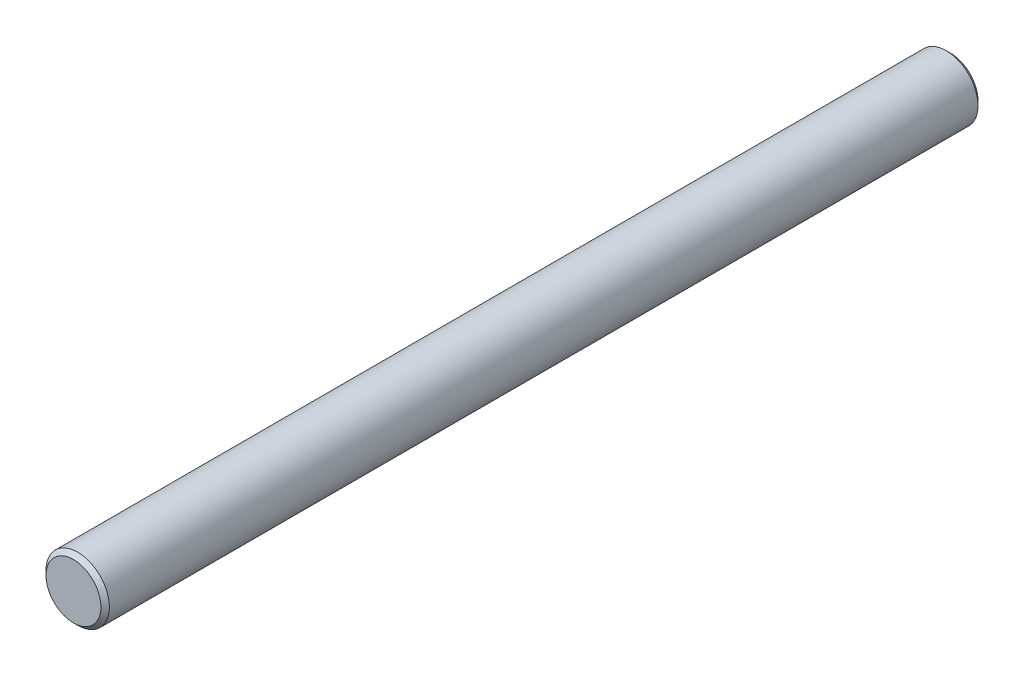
ISO-10303-21;
HEADER;
FILE_DESCRIPTION(('STEP AP214'),'2;1');
FILE_NAME('part.step','',(''),(''),'','','');
FILE_SCHEMA(('AUTOMOTIVE_DESIGN { 1 0 10303 214 1 1 1 1 }'));
ENDSEC;
DATA;
#1=APPLICATION_CONTEXT('core data for automotive mechanical design processes');
#2=APPLICATION_PROTOCOL_DEFINITION('international standard','automotive_design',2000,#1);
#3=PRODUCT_CONTEXT('',#1,'mechanical');
#4=PRODUCT('Part','Part','',(#3));
#5=PRODUCT_RELATED_PRODUCT_CATEGORY('part','',(#4));
#6=PRODUCT_DEFINITION_FORMATION('','',#4);
#7=PRODUCT_DEFINITION_CONTEXT('part definition',#1,'design');
#8=PRODUCT_DEFINITION('design','',#6,#7);
#9=PRODUCT_DEFINITION_SHAPE('','',#8);
#10=(LENGTH_UNIT() NAMED_UNIT(*) SI_UNIT(.MILLI.,.METRE.));
#11=(NAMED_UNIT(*) PLANE_ANGLE_UNIT() SI_UNIT($,.RADIAN.));
#12=(NAMED_UNIT(*) SI_UNIT($,.STERADIAN.) SOLID_ANGLE_UNIT());
#13=UNCERTAINTY_MEASURE_WITH_UNIT(LENGTH_MEASURE(1.E-05),#10,'distance_accuracy_value','');
#14=(GEOMETRIC_REPRESENTATION_CONTEXT(3) GLOBAL_UNCERTAINTY_ASSIGNED_CONTEXT((#13)) GLOBAL_UNIT_ASSIGNED_CONTEXT((#10,
#11,#12)) REPRESENTATION_CONTEXT('',''));
#15=CARTESIAN_POINT('',(0.,0.,0.));
#16=DIRECTION('',(0.,0.,1.));
#17=DIRECTION('',(1.,0.,0.));
#18=AXIS2_PLACEMENT_3D('',#15,#16,#17);
#19=CARTESIAN_POINT('',(0.,0.,20.75));
#20=DIRECTION('',(0.,0.,-1.));
#21=DIRECTION('',(-1.,0.,0.));
#22=AXIS2_PLACEMENT_3D('',#19,#20,#21);
#23=CYLINDRICAL_SURFACE('',#22,1.5);
#24=CARTESIAN_POINT('',(0.,0.,-20.55));
#25=DIRECTION('',(0.,0.,1.));
#26=DIRECTION('',(1.,0.,0.));
#27=AXIS2_PLACEMENT_3D('',#24,#25,#26);
#28=CIRCLE('',#27,1.5);
#29=CARTESIAN_POINT('',(-1.50000000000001,0.,-20.55));
#30=VERTEX_POINT('',#29);
#31=EDGE_CURVE('E39',#30,#30,#28,.T.);
#32=CARTESIAN_POINT('',(0.,0.,20.55));
#33=DIRECTION('',(0.,0.,1.));
#34=DIRECTION('',(1.,0.,0.));
#35=AXIS2_PLACEMENT_3D('',#32,#33,#34);
#36=CIRCLE('',#35,1.5);
#37=CARTESIAN_POINT('',(-1.50000000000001,0.,20.55));
#38=VERTEX_POINT('',#37);
#39=EDGE_CURVE('E43',#38,#38,#36,.F.);
#40=CARTESIAN_POINT('',(-1.50000000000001,0.,-20.55));
#41=CARTESIAN_POINT('',(-1.50000000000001,0.,-20.121875));
#42=CARTESIAN_POINT('',(-1.50000000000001,0.,-19.69375));
#43=CARTESIAN_POINT('',(-1.50000000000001,0.,-18.8375));
#44=CARTESIAN_POINT('',(-1.50000000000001,0.,-18.409375));
#45=CARTESIAN_POINT('',(-1.50000000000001,0.,-17.553125));
#46=CARTESIAN_POINT('',(-1.50000000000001,0.,-17.125));
#47=CARTESIAN_POINT('',(-1.50000000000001,0.,-16.26875));
#48=CARTESIAN_POINT('',(-1.50000000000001,0.,-15.840625));
#49=CARTESIAN_POINT('',(-1.50000000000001,0.,-14.984375));
#50=CARTESIAN_POINT('',(-1.50000000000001,0.,-14.55625));
#51=CARTESIAN_POINT('',(-1.50000000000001,0.,-13.7));
#52=CARTESIAN_POINT('',(-1.50000000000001,0.,-13.271875));
#53=CARTESIAN_POINT('',(-1.50000000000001,0.,-12.415625));
#54=CARTESIAN_POINT('',(-1.50000000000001,0.,-11.9875));
#55=CARTESIAN_POINT('',(-1.50000000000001,0.,-11.13125));
#56=CARTESIAN_POINT('',(-1.50000000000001,0.,-10.703125));
#57=CARTESIAN_POINT('',(-1.50000000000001,0.,-9.84687500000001));
#58=CARTESIAN_POINT('',(-1.50000000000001,0.,-9.41875));
#59=CARTESIAN_POINT('',(-1.50000000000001,0.,-8.56250000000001));
#60=CARTESIAN_POINT('',(-1.50000000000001,0.,-8.134375));
#61=CARTESIAN_POINT('',(-1.50000000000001,0.,-7.27812500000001));
#62=CARTESIAN_POINT('',(-1.50000000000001,0.,-6.85000000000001));
#63=CARTESIAN_POINT('',(-1.50000000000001,0.,-5.99375000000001));
#64=CARTESIAN_POINT('',(-1.50000000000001,0.,-5.56562500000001));
#65=CARTESIAN_POINT('',(-1.50000000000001,0.,-4.70937500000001));
#66=CARTESIAN_POINT('',(-1.50000000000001,0.,-4.28125000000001));
#67=CARTESIAN_POINT('',(-1.50000000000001,0.,-3.42500000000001));
#68=CARTESIAN_POINT('',(-1.50000000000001,0.,-2.99687500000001));
#69=CARTESIAN_POINT('',(-1.50000000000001,0.,-2.14062500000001));
#70=CARTESIAN_POINT('',(-1.50000000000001,0.,-1.71250000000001));
#71=CARTESIAN_POINT('',(-1.50000000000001,0.,-0.856250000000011));
#72=CARTESIAN_POINT('',(-1.50000000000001,0.,-0.428125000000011));
#73=CARTESIAN_POINT('',(-1.50000000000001,0.,0.42812499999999));
#74=CARTESIAN_POINT('',(-1.50000000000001,0.,0.85624999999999));
#75=CARTESIAN_POINT('',(-1.50000000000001,0.,1.71249999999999));
#76=CARTESIAN_POINT('',(-1.50000000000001,0.,2.14062499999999));
#77=CARTESIAN_POINT('',(-1.50000000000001,0.,2.99687499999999));
#78=CARTESIAN_POINT('',(-1.50000000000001,0.,3.42499999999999));
#79=CARTESIAN_POINT('',(-1.50000000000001,0.,4.28124999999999));
#80=CARTESIAN_POINT('',(-1.50000000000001,0.,4.70937499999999));
#81=CARTESIAN_POINT('',(-1.50000000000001,0.,5.56562499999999));
#82=CARTESIAN_POINT('',(-1.50000000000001,0.,5.99374999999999));
#83=CARTESIAN_POINT('',(-1.50000000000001,0.,6.84999999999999));
#84=CARTESIAN_POINT('',(-1.50000000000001,0.,7.27812499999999));
#85=CARTESIAN_POINT('',(-1.50000000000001,0.,8.13437499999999));
#86=CARTESIAN_POINT('',(-1.50000000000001,0.,8.56249999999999));
#87=CARTESIAN_POINT('',(-1.50000000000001,0.,9.41874999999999));
#88=CARTESIAN_POINT('',(-1.50000000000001,0.,9.84687499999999));
#89=CARTESIAN_POINT('',(-1.50000000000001,0.,10.703125));
#90=CARTESIAN_POINT('',(-1.50000000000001,0.,11.13125));
#91=CARTESIAN_POINT('',(-1.50000000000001,0.,11.9875));
#92=CARTESIAN_POINT('',(-1.50000000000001,0.,12.415625));
#93=CARTESIAN_POINT('',(-1.50000000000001,0.,13.271875));
#94=CARTESIAN_POINT('',(-1.50000000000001,0.,13.7));
#95=CARTESIAN_POINT('',(-1.50000000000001,0.,14.55625));
#96=CARTESIAN_POINT('',(-1.50000000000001,0.,14.984375));
#97=CARTESIAN_POINT('',(-1.50000000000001,0.,15.840625));
#98=CARTESIAN_POINT('',(-1.50000000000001,0.,16.26875));
#99=CARTESIAN_POINT('',(-1.50000000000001,0.,17.125));
#100=CARTESIAN_POINT('',(-1.50000000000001,0.,17.553125));
#101=CARTESIAN_POINT('',(-1.50000000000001,0.,18.409375));
#102=CARTESIAN_POINT('',(-1.50000000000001,0.,18.8375));
#103=CARTESIAN_POINT('',(-1.50000000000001,0.,19.69375));
#104=CARTESIAN_POINT('',(-1.50000000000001,0.,20.121875));
#105=CARTESIAN_POINT('',(-1.50000000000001,0.,20.55));
#106=B_SPLINE_CURVE_WITH_KNOTS('',3,(#40,#41,#42,#43,#44,#45,#46,#47,#48,#49,#50,#51,#52,#53,
#54,#55,#56,#57,#58,#59,#60,#61,#62,#63,#64,#65,#66,#67,#68,#69,#70,#71,#72,#73,#74,#75,#76,#77,
#78,#79,#80,#81,#82,#83,#84,#85,#86,#87,#88,#89,#90,#91,#92,#93,#94,#95,#96,#97,#98,#99,#100,
#101,#102,#103,#104,#105),.UNSPECIFIED.,.F.,.F.,(4,2,2,2,2,2,2,2,2,2,2,2,2,2,2,2,2,2,2,2,2,2,2,
2,2,2,2,2,2,2,2,2,4),(0.,1.284375,2.56875,3.853125,5.1375,6.421875,7.70625,8.990625,10.275,
11.559375,12.84375,14.128125,15.4125,16.696875,17.98125,19.265625,20.55,21.834375,23.11875,
24.403125,25.6875,26.971875,28.25625,29.540625,30.825,32.109375,33.39375,34.678125,35.9625,
37.246875,38.53125,39.815625,41.1),.UNSPECIFIED.);
#107=EDGE_CURVE('BSEAM29',#30,#38,#106,.T.);
#108=ORIENTED_EDGE('',*,*,#31,.T.);
#109=ORIENTED_EDGE('',*,*,#39,.T.);
#110=ORIENTED_EDGE('',*,*,#107,.T.);
#111=ORIENTED_EDGE('',*,*,#107,.F.);
#112=EDGE_LOOP('',(#108,#110,#109,#111));
#113=FACE_BOUND('',#112,.T.);
#114=ADVANCED_FACE('F29',(#113),#23,.T.);
#115=CARTESIAN_POINT('',(0.,0.,20.75));
#116=DIRECTION('',(0.,0.,1.));
#117=DIRECTION('',(1.,0.,0.));
#118=AXIS2_PLACEMENT_3D('',#115,#116,#117);
#119=PLANE('',#118);
#120=CARTESIAN_POINT('',(0.,0.,20.75));
#121=DIRECTION('',(0.,0.,1.));
#122=DIRECTION('',(1.,0.,0.));
#123=AXIS2_PLACEMENT_3D('',#120,#121,#122);
#124=CIRCLE('',#123,1.3);
#125=CARTESIAN_POINT('',(-1.30000000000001,0.,20.75));
#126=VERTEX_POINT('',#125);
#127=EDGE_CURVE('E10',#126,#126,#124,.T.);
#128=ORIENTED_EDGE('',*,*,#127,.T.);
#129=EDGE_LOOP('',(#128));
#130=FACE_BOUND('',#129,.T.);
#131=ADVANCED_FACE('F62',(#130),#119,.T.);
#132=CARTESIAN_POINT('',(0.,0.,-20.75));
#133=DIRECTION('',(0.,0.,1.));
#134=DIRECTION('',(1.,0.,0.));
#135=AXIS2_PLACEMENT_3D('',#132,#133,#134);
#136=PLANE('',#135);
#137=CARTESIAN_POINT('',(0.,0.,-20.75));
#138=DIRECTION('',(0.,0.,1.));
#139=DIRECTION('',(1.,0.,0.));
#140=AXIS2_PLACEMENT_3D('',#137,#138,#139);
#141=CIRCLE('',#140,1.3);
#142=CARTESIAN_POINT('',(1.30000000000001,0.,-20.75));
#143=VERTEX_POINT('',#142);
#144=EDGE_CURVE('E35',#143,#143,#141,.F.);
#145=ORIENTED_EDGE('',*,*,#144,.T.);
#146=EDGE_LOOP('',(#145));
#147=FACE_BOUND('',#146,.T.);
#148=ADVANCED_FACE('F58',(#147),#136,.F.);
#149=CARTESIAN_POINT('',(0.,0.,-20.55));
#150=DIRECTION('',(0.,0.,1.));
#151=DIRECTION('',(1.,0.,0.));
#152=AXIS2_PLACEMENT_3D('',#149,#150,#151);
#153=CONICAL_SURFACE('',#152,1.5,0.785398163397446);
#154=ORIENTED_EDGE('',*,*,#144,.F.);
#155=EDGE_LOOP('',(#154));
#156=FACE_BOUND('',#155,.T.);
#157=ORIENTED_EDGE('',*,*,#31,.F.);
#158=EDGE_LOOP('',(#157));
#159=FACE_BOUND('',#158,.T.);
#160=ADVANCED_FACE('F53',(#156,#159),#153,.T.);
#161=CARTESIAN_POINT('',(0.,0.,20.75));
#162=DIRECTION('',(0.,0.,-1.));
#163=DIRECTION('',(-1.,0.,0.));
#164=AXIS2_PLACEMENT_3D('',#161,#162,#163);
#165=CONICAL_SURFACE('',#164,1.3,0.785398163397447);
#166=CARTESIAN_POINT('',(-1.50000000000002,0.,20.55));
#167=CARTESIAN_POINT('',(-1.49791666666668,0.,20.5520833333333));
#168=CARTESIAN_POINT('',(-1.49583333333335,0.,20.5541666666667));
#169=CARTESIAN_POINT('',(-1.49166666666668,0.,20.5583333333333));
#170=CARTESIAN_POINT('',(-1.48958333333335,0.,20.5604166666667));
#171=CARTESIAN_POINT('',(-1.48541666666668,0.,20.5645833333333));
#172=CARTESIAN_POINT('',(-1.48333333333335,0.,20.5666666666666));
#173=CARTESIAN_POINT('',(-1.47916666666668,0.,20.5708333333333));
#174=CARTESIAN_POINT('',(-1.47708333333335,0.,20.5729166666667));
#175=CARTESIAN_POINT('',(-1.47291666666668,0.,20.5770833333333));
#176=CARTESIAN_POINT('',(-1.47083333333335,0.,20.5791666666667));
#177=CARTESIAN_POINT('',(-1.46666666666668,0.,20.5833333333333));
#178=CARTESIAN_POINT('',(-1.46458333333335,0.,20.5854166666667));
#179=CARTESIAN_POINT('',(-1.46041666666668,0.,20.5895833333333));
#180=CARTESIAN_POINT('',(-1.45833333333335,0.,20.5916666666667));
#181=CARTESIAN_POINT('',(-1.45416666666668,0.,20.5958333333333));
#182=CARTESIAN_POINT('',(-1.45208333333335,0.,20.5979166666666));
#183=CARTESIAN_POINT('',(-1.44791666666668,0.,20.6020833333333));
#184=CARTESIAN_POINT('',(-1.44583333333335,0.,20.6041666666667));
#185=CARTESIAN_POINT('',(-1.44166666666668,0.,20.6083333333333));
#186=CARTESIAN_POINT('',(-1.43958333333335,0.,20.6104166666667));
#187=CARTESIAN_POINT('',(-1.43541666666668,0.,20.6145833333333));
#188=CARTESIAN_POINT('',(-1.43333333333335,0.,20.6166666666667));
#189=CARTESIAN_POINT('',(-1.42916666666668,0.,20.6208333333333));
#190=CARTESIAN_POINT('',(-1.42708333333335,0.,20.6229166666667));
#191=CARTESIAN_POINT('',(-1.42291666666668,0.,20.6270833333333));
#192=CARTESIAN_POINT('',(-1.42083333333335,0.,20.6291666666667));
#193=CARTESIAN_POINT('',(-1.41666666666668,0.,20.6333333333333));
#194=CARTESIAN_POINT('',(-1.41458333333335,0.,20.6354166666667));
#195=CARTESIAN_POINT('',(-1.41041666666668,0.,20.6395833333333));
#196=CARTESIAN_POINT('',(-1.40833333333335,0.,20.6416666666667));
#197=CARTESIAN_POINT('',(-1.40416666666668,0.,20.6458333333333));
#198=CARTESIAN_POINT('',(-1.40208333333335,0.,20.6479166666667));
#199=CARTESIAN_POINT('',(-1.39791666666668,0.,20.6520833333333));
#200=CARTESIAN_POINT('',(-1.39583333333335,0.,20.6541666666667));
#201=CARTESIAN_POINT('',(-1.39166666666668,0.,20.6583333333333));
#202=CARTESIAN_POINT('',(-1.38958333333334,0.,20.6604166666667));
#203=CARTESIAN_POINT('',(-1.38541666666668,0.,20.6645833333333));
#204=CARTESIAN_POINT('',(-1.38333333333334,0.,20.6666666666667));
#205=CARTESIAN_POINT('',(-1.37916666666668,0.,20.6708333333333));
#206=CARTESIAN_POINT('',(-1.37708333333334,0.,20.6729166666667));
#207=CARTESIAN_POINT('',(-1.37291666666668,0.,20.6770833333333));
#208=CARTESIAN_POINT('',(-1.37083333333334,0.,20.6791666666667));
#209=CARTESIAN_POINT('',(-1.36666666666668,0.,20.6833333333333));
#210=CARTESIAN_POINT('',(-1.36458333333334,0.,20.6854166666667));
#211=CARTESIAN_POINT('',(-1.36041666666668,0.,20.6895833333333));
#212=CARTESIAN_POINT('',(-1.35833333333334,0.,20.6916666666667));
#213=CARTESIAN_POINT('',(-1.35416666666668,0.,20.6958333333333));
#214=CARTESIAN_POINT('',(-1.35208333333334,0.,20.6979166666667));
#215=CARTESIAN_POINT('',(-1.34791666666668,0.,20.7020833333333));
#216=CARTESIAN_POINT('',(-1.34583333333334,0.,20.7041666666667));
#217=CARTESIAN_POINT('',(-1.34166666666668,0.,20.7083333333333));
#218=CARTESIAN_POINT('',(-1.33958333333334,0.,20.7104166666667));
#219=CARTESIAN_POINT('',(-1.33541666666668,0.,20.7145833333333));
#220=CARTESIAN_POINT('',(-1.33333333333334,0.,20.7166666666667));
#221=CARTESIAN_POINT('',(-1.32916666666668,0.,20.7208333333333));
#222=CARTESIAN_POINT('',(-1.32708333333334,0.,20.7229166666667));
#223=CARTESIAN_POINT('',(-1.32291666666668,0.,20.7270833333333));
#224=CARTESIAN_POINT('',(-1.32083333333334,0.,20.7291666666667));
#225=CARTESIAN_POINT('',(-1.31666666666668,0.,20.7333333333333));
#226=CARTESIAN_POINT('',(-1.31458333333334,0.,20.7354166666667));
#227=CARTESIAN_POINT('',(-1.31041666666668,0.,20.7395833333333));
#228=CARTESIAN_POINT('',(-1.30833333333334,0.,20.7416666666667));
#229=CARTESIAN_POINT('',(-1.30416666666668,0.,20.7458333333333));
#230=CARTESIAN_POINT('',(-1.30208333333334,0.,20.7479166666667));
#231=CARTESIAN_POINT('',(-1.30000000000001,0.,20.75));
#232=B_SPLINE_CURVE_WITH_KNOTS('',3,(#166,#167,#168,#169,#170,#171,#172,#173,#174,#175,#176,
#177,#178,#179,#180,#181,#182,#183,#184,#185,#186,#187,#188,#189,#190,#191,#192,#193,#194,#195,
#196,#197,#198,#199,#200,#201,#202,#203,#204,#205,#206,#207,#208,#209,#210,#211,#212,#213,#214,
#215,#216,#217,#218,#219,#220,#221,#222,#223,#224,#225,#226,#227,#228,#229,#230,#231),
.UNSPECIFIED.,.F.,.F.,(4,2,2,2,2,2,2,2,2,2,2,2,2,2,2,2,2,2,2,2,2,2,2,2,2,2,2,2,2,2,2,2,4),(0.,
0.00883883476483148,0.0176776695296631,0.0265165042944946,0.0353553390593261,0.04419417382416,
0.0530330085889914,0.0618718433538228,0.0707106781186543,0.0795495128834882,0.0883883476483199,
0.0972271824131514,0.106066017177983,0.114904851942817,0.123743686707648,0.13258252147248,
0.141421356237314,0.150260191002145,0.159099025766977,0.167937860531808,0.17677669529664,
0.185615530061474,0.194454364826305,0.203293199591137,0.21213203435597,0.220970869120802,
0.229809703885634,0.238648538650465,0.247487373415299,0.25632620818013,0.265165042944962,
0.274003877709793,0.282842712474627),.UNSPECIFIED.);
#233=EDGE_CURVE('BSEAM50',#38,#126,#232,.T.);
#234=ORIENTED_EDGE('',*,*,#39,.F.);
#235=ORIENTED_EDGE('',*,*,#127,.F.);
#236=ORIENTED_EDGE('',*,*,#233,.T.);
#237=ORIENTED_EDGE('',*,*,#233,.F.);
#238=EDGE_LOOP('',(#234,#236,#235,#237));
#239=FACE_BOUND('',#238,.T.);
#240=ADVANCED_FACE('F50',(#239),#165,.T.);
#241=CLOSED_SHELL('',(#114,#131,#148,#160,#240));
#242=MANIFOLD_SOLID_BREP('B2',#241);
#243=ADVANCED_BREP_SHAPE_REPRESENTATION('',(#18,#242),#14);
#244=SHAPE_DEFINITION_REPRESENTATION(#9,#243);
ENDSEC;
END-ISO-10303-21;
